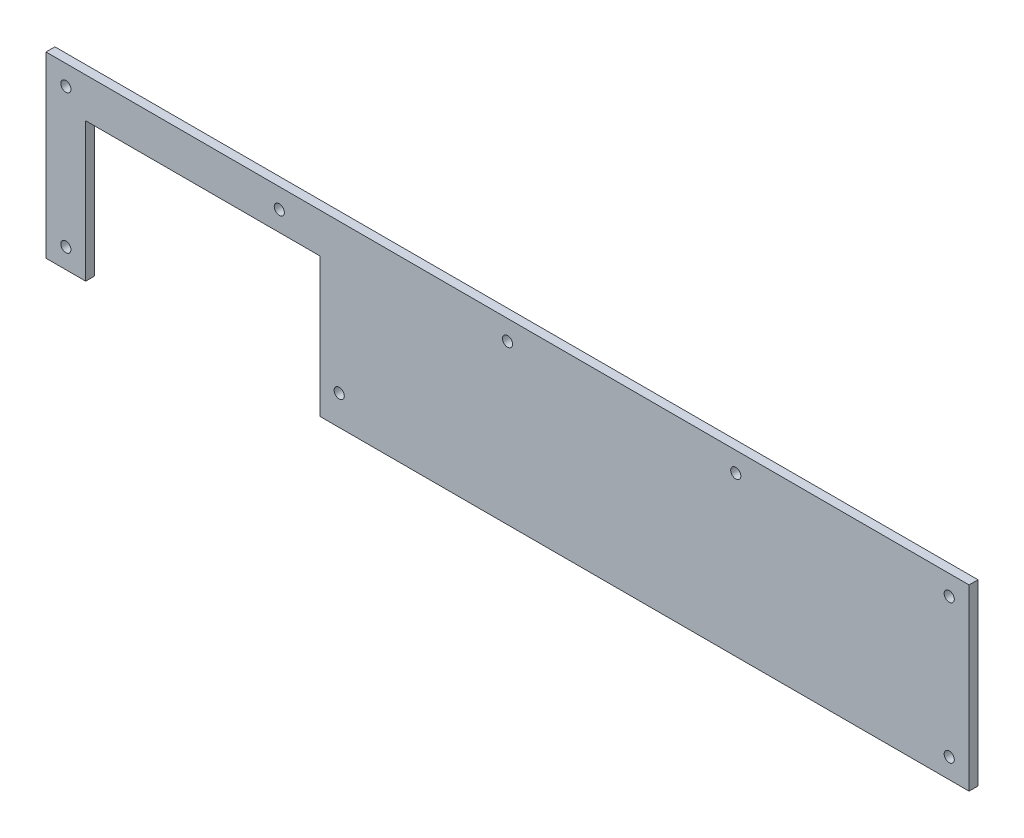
ISO-10303-21;
HEADER;
FILE_DESCRIPTION(('STEP AP214'),'2;1');
FILE_NAME('part.step','',(''),(''),'','','');
FILE_SCHEMA(('AUTOMOTIVE_DESIGN { 1 0 10303 214 1 1 1 1 }'));
ENDSEC;
DATA;
#1=APPLICATION_CONTEXT('core data for automotive mechanical design processes');
#2=APPLICATION_PROTOCOL_DEFINITION('international standard','automotive_design',2000,#1);
#3=PRODUCT_CONTEXT('',#1,'mechanical');
#4=PRODUCT('Part','Part','',(#3));
#5=PRODUCT_RELATED_PRODUCT_CATEGORY('part','',(#4));
#6=PRODUCT_DEFINITION_FORMATION('','',#4);
#7=PRODUCT_DEFINITION_CONTEXT('part definition',#1,'design');
#8=PRODUCT_DEFINITION('design','',#6,#7);
#9=PRODUCT_DEFINITION_SHAPE('','',#8);
#10=(LENGTH_UNIT() NAMED_UNIT(*) SI_UNIT(.MILLI.,.METRE.));
#11=(NAMED_UNIT(*) PLANE_ANGLE_UNIT() SI_UNIT($,.RADIAN.));
#12=(NAMED_UNIT(*) SI_UNIT($,.STERADIAN.) SOLID_ANGLE_UNIT());
#13=UNCERTAINTY_MEASURE_WITH_UNIT(LENGTH_MEASURE(1.E-05),#10,'distance_accuracy_value','');
#14=(GEOMETRIC_REPRESENTATION_CONTEXT(3) GLOBAL_UNCERTAINTY_ASSIGNED_CONTEXT((#13)) GLOBAL_UNIT_ASSIGNED_CONTEXT((#10,
#11,#12)) REPRESENTATION_CONTEXT('',''));
#15=CARTESIAN_POINT('',(0.,0.,0.));
#16=DIRECTION('',(0.,0.,1.));
#17=DIRECTION('',(1.,0.,0.));
#18=AXIS2_PLACEMENT_3D('',#15,#16,#17);
#19=CARTESIAN_POINT('',(-232.500000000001,-44.9999999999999,2.24789999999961));
#20=DIRECTION('',(0.,1.,0.));
#21=DIRECTION('',(0.,0.,1.));
#22=AXIS2_PLACEMENT_3D('',#19,#20,#21);
#23=PLANE('',#22);
#24=DIRECTION('',(1.00000000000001,0.,0.));
#25=VECTOR('',#24,1.);
#26=CARTESIAN_POINT('',(-232.500000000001,-45.,-2.24790000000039));
#27=LINE('',#26,#25);
#28=CARTESIAN_POINT('',(-232.500000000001,-45.,-2.24790000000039));
#29=VERTEX_POINT('',#28);
#30=CARTESIAN_POINT('',(-212.500000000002,-45.,-2.24790000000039));
#31=VERTEX_POINT('',#30);
#32=EDGE_CURVE('E203',#29,#31,#27,.T.);
#33=ORIENTED_EDGE('',*,*,#32,.T.);
#34=DIRECTION('',(0.,0.,-1.));
#35=VECTOR('',#34,1.);
#36=CARTESIAN_POINT('',(-212.500000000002,-44.9999999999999,2.24789999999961));
#37=LINE('',#36,#35);
#38=CARTESIAN_POINT('',(-212.500000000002,-44.9999999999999,2.24789999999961));
#39=VERTEX_POINT('',#38);
#40=EDGE_CURVE('E153',#39,#31,#37,.T.);
#41=ORIENTED_EDGE('',*,*,#40,.F.);
#42=DIRECTION('',(1.00000000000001,0.,0.));
#43=VECTOR('',#42,1.);
#44=CARTESIAN_POINT('',(-232.500000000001,-44.9999999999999,2.24789999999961));
#45=LINE('',#44,#43);
#46=CARTESIAN_POINT('',(-232.500000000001,-44.9999999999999,2.24789999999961));
#47=VERTEX_POINT('',#46);
#48=EDGE_CURVE('E142',#47,#39,#45,.T.);
#49=ORIENTED_EDGE('',*,*,#48,.F.);
#50=DIRECTION('',(0.,0.,-1.));
#51=VECTOR('',#50,1.);
#52=CARTESIAN_POINT('',(-232.500000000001,-44.9999999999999,2.24789999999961));
#53=LINE('',#52,#51);
#54=EDGE_CURVE('E218',#47,#29,#53,.T.);
#55=ORIENTED_EDGE('',*,*,#54,.T.);
#56=EDGE_LOOP('',(#33,#41,#49,#55));
#57=FACE_BOUND('',#56,.T.);
#58=ADVANCED_FACE('F46',(#57),#23,.F.);
#59=CARTESIAN_POINT('',(0.,0.,2.2479));
#60=DIRECTION('',(0.,0.,-1.));
#61=DIRECTION('',(-1.00000000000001,0.,0.));
#62=AXIS2_PLACEMENT_3D('',#59,#60,#61);
#63=PLANE('',#62);
#64=CARTESIAN_POINT('',(-84.8000000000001,-30.,2.2479));
#65=DIRECTION('',(0.,0.,-1.));
#66=DIRECTION('',(-1.00000000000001,0.,0.));
#67=AXIS2_PLACEMENT_3D('',#64,#65,#66);
#68=CIRCLE('',#67,2.54999999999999);
#69=CARTESIAN_POINT('',(-87.3500000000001,-30.,2.24789999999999));
#70=VERTEX_POINT('',#69);
#71=EDGE_CURVE('E147',#70,#70,#68,.F.);
#72=ORIENTED_EDGE('',*,*,#71,.F.);
#73=EDGE_LOOP('',(#72));
#74=FACE_BOUND('',#73,.T.);
#75=ORIENTED_EDGE('',*,*,#48,.T.);
#76=DIRECTION('',(0.,1.,0.));
#77=VECTOR('',#76,1.);
#78=CARTESIAN_POINT('',(-212.500000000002,-44.9999999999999,2.24789999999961));
#79=LINE('',#78,#77);
#80=CARTESIAN_POINT('',(-212.500000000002,25.,2.2479));
#81=VERTEX_POINT('',#80);
#82=EDGE_CURVE('E123',#39,#81,#79,.T.);
#83=ORIENTED_EDGE('',*,*,#82,.T.);
#84=DIRECTION('',(1.00000000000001,0.,0.));
#85=VECTOR('',#84,1.);
#86=CARTESIAN_POINT('',(-212.500000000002,25.,2.2479));
#87=LINE('',#86,#85);
#88=CARTESIAN_POINT('',(-94.5000000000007,25.,2.2479));
#89=VERTEX_POINT('',#88);
#90=EDGE_CURVE('E134',#81,#89,#87,.T.);
#91=ORIENTED_EDGE('',*,*,#90,.T.);
#92=DIRECTION('',(0.,-1.,0.));
#93=VECTOR('',#92,1.);
#94=CARTESIAN_POINT('',(-94.5000000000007,-44.9999999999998,2.2479));
#95=LINE('',#94,#93);
#96=CARTESIAN_POINT('',(-94.5000000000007,-44.9999999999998,2.2479));
#97=VERTEX_POINT('',#96);
#98=EDGE_CURVE('E131',#89,#97,#95,.T.);
#99=ORIENTED_EDGE('',*,*,#98,.T.);
#100=CARTESIAN_POINT('',(232.500000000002,-44.9999999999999,2.24790000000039));
#101=VERTEX_POINT('',#100);
#102=EDGE_CURVE('E70',#97,#101,#45,.T.);
#103=ORIENTED_EDGE('',*,*,#102,.T.);
#104=DIRECTION('',(0.,1.,0.));
#105=VECTOR('',#104,1.);
#106=CARTESIAN_POINT('',(232.500000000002,-44.9999999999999,2.24790000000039));
#107=LINE('',#106,#105);
#108=CARTESIAN_POINT('',(232.500000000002,45.0000000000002,2.24790000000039));
#109=VERTEX_POINT('',#108);
#110=EDGE_CURVE('E201',#101,#109,#107,.T.);
#111=ORIENTED_EDGE('',*,*,#110,.T.);
#112=DIRECTION('',(-1.00000000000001,0.,0.));
#113=VECTOR('',#112,1.);
#114=CARTESIAN_POINT('',(-232.500000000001,45.,2.2479));
#115=LINE('',#114,#113);
#116=CARTESIAN_POINT('',(-232.500000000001,45.,2.2479));
#117=VERTEX_POINT('',#116);
#118=EDGE_CURVE('E98',#109,#117,#115,.T.);
#119=ORIENTED_EDGE('',*,*,#118,.T.);
#120=DIRECTION('',(0.,-1.,0.));
#121=VECTOR('',#120,1.);
#122=CARTESIAN_POINT('',(-232.500000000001,-44.9999999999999,2.24789999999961));
#123=LINE('',#122,#121);
#124=EDGE_CURVE('E205',#117,#47,#123,.T.);
#125=ORIENTED_EDGE('',*,*,#124,.T.);
#126=EDGE_LOOP('',(#75,#83,#91,#99,#103,#111,#119,#125));
#127=FACE_BOUND('',#126,.T.);
#128=CARTESIAN_POINT('',(-222.500000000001,35.,2.24789999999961));
#129=DIRECTION('',(0.,0.,1.));
#130=DIRECTION('',(1.00000000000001,0.,0.));
#131=AXIS2_PLACEMENT_3D('',#128,#129,#130);
#132=CIRCLE('',#131,2.54999999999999);
#133=CARTESIAN_POINT('',(-219.950000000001,35.,2.24789999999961));
#134=VERTEX_POINT('',#133);
#135=EDGE_CURVE('E195',#134,#134,#132,.T.);
#136=ORIENTED_EDGE('',*,*,#135,.F.);
#137=EDGE_LOOP('',(#136));
#138=FACE_BOUND('',#137,.T.);
#139=CARTESIAN_POINT('',(-222.500000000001,-34.9999999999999,2.24789999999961));
#140=DIRECTION('',(0.,0.,1.));
#141=DIRECTION('',(1.00000000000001,0.,0.));
#142=AXIS2_PLACEMENT_3D('',#139,#140,#141);
#143=CIRCLE('',#142,2.54999999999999);
#144=CARTESIAN_POINT('',(-219.950000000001,-34.9999999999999,2.24789999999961));
#145=VERTEX_POINT('',#144);
#146=EDGE_CURVE('E189',#145,#145,#143,.T.);
#147=ORIENTED_EDGE('',*,*,#146,.F.);
#148=EDGE_LOOP('',(#147));
#149=FACE_BOUND('',#148,.T.);
#150=CARTESIAN_POINT('',(0.,35.,2.2479));
#151=DIRECTION('',(0.,0.,1.));
#152=DIRECTION('',(1.00000000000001,0.,0.));
#153=AXIS2_PLACEMENT_3D('',#150,#151,#152);
#154=CIRCLE('',#153,2.55);
#155=CARTESIAN_POINT('',(2.55000000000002,35.,2.2479));
#156=VERTEX_POINT('',#155);
#157=EDGE_CURVE('E183',#156,#156,#154,.T.);
#158=ORIENTED_EDGE('',*,*,#157,.F.);
#159=EDGE_LOOP('',(#158));
#160=FACE_BOUND('',#159,.T.);
#161=CARTESIAN_POINT('',(-114.975000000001,35.,2.2479));
#162=DIRECTION('',(0.,0.,1.));
#163=DIRECTION('',(1.00000000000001,0.,0.));
#164=AXIS2_PLACEMENT_3D('',#161,#162,#163);
#165=CIRCLE('',#164,2.54999999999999);
#166=CARTESIAN_POINT('',(-112.425000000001,35.,2.2479));
#167=VERTEX_POINT('',#166);
#168=EDGE_CURVE('E177',#167,#167,#165,.T.);
#169=ORIENTED_EDGE('',*,*,#168,.F.);
#170=EDGE_LOOP('',(#169));
#171=FACE_BOUND('',#170,.T.);
#172=CARTESIAN_POINT('',(222.500000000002,-34.9999999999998,2.24790000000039));
#173=DIRECTION('',(0.,0.,1.));
#174=DIRECTION('',(-1.00000000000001,0.,0.));
#175=AXIS2_PLACEMENT_3D('',#172,#173,#174);
#176=CIRCLE('',#175,2.54999999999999);
#177=CARTESIAN_POINT('',(219.950000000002,-34.9999999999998,2.24790000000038));
#178=VERTEX_POINT('',#177);
#179=EDGE_CURVE('E171',#178,#178,#176,.T.);
#180=ORIENTED_EDGE('',*,*,#179,.F.);
#181=EDGE_LOOP('',(#180));
#182=FACE_BOUND('',#181,.T.);
#183=CARTESIAN_POINT('',(222.500000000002,35.0000000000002,2.24790000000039));
#184=DIRECTION('',(0.,0.,1.));
#185=DIRECTION('',(-1.00000000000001,0.,0.));
#186=AXIS2_PLACEMENT_3D('',#183,#184,#185);
#187=CIRCLE('',#186,2.54999999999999);
#188=CARTESIAN_POINT('',(219.950000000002,35.0000000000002,2.24790000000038));
#189=VERTEX_POINT('',#188);
#190=EDGE_CURVE('E165',#189,#189,#187,.T.);
#191=ORIENTED_EDGE('',*,*,#190,.F.);
#192=EDGE_LOOP('',(#191));
#193=FACE_BOUND('',#192,.T.);
#194=CARTESIAN_POINT('',(114.975000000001,35.,2.24790000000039));
#195=DIRECTION('',(0.,0.,1.));
#196=DIRECTION('',(-1.00000000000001,0.,0.));
#197=AXIS2_PLACEMENT_3D('',#194,#195,#196);
#198=CIRCLE('',#197,2.54999999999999);
#199=CARTESIAN_POINT('',(112.425000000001,35.,2.24790000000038));
#200=VERTEX_POINT('',#199);
#201=EDGE_CURVE('E159',#200,#200,#198,.T.);
#202=ORIENTED_EDGE('',*,*,#201,.F.);
#203=EDGE_LOOP('',(#202));
#204=FACE_BOUND('',#203,.T.);
#205=ADVANCED_FACE('F139',(#74,#127,#138,#149,#160,#171,#182,#193,#204),#63,.F.);
#206=CARTESIAN_POINT('',(0.,1.94289029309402E-13,-2.2479));
#207=DIRECTION('',(0.,0.,-1.));
#208=DIRECTION('',(-1.00000000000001,0.,0.));
#209=AXIS2_PLACEMENT_3D('',#206,#207,#208);
#210=PLANE('',#209);
#211=CARTESIAN_POINT('',(-84.8000000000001,-30.,-2.2479));
#212=DIRECTION('',(0.,0.,-1.));
#213=DIRECTION('',(-1.00000000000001,0.,0.));
#214=AXIS2_PLACEMENT_3D('',#211,#212,#213);
#215=CIRCLE('',#214,2.54999999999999);
#216=CARTESIAN_POINT('',(-87.3500000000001,-30.,-2.2479));
#217=VERTEX_POINT('',#216);
#218=EDGE_CURVE('E306',#217,#217,#215,.T.);
#219=ORIENTED_EDGE('',*,*,#218,.F.);
#220=EDGE_LOOP('',(#219));
#221=FACE_BOUND('',#220,.T.);
#222=DIRECTION('',(0.,1.,0.));
#223=VECTOR('',#222,1.);
#224=CARTESIAN_POINT('',(-212.500000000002,-45.,-2.24790000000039));
#225=LINE('',#224,#223);
#226=CARTESIAN_POINT('',(-212.500000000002,25.,-2.24790000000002));
#227=VERTEX_POINT('',#226);
#228=EDGE_CURVE('E126',#31,#227,#225,.T.);
#229=ORIENTED_EDGE('',*,*,#228,.F.);
#230=ORIENTED_EDGE('',*,*,#32,.F.);
#231=DIRECTION('',(0.,-1.,0.));
#232=VECTOR('',#231,1.);
#233=CARTESIAN_POINT('',(-232.500000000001,-45.,-2.24790000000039));
#234=LINE('',#233,#232);
#235=CARTESIAN_POINT('',(-232.500000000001,45.,-2.2479));
#236=VERTEX_POINT('',#235);
#237=EDGE_CURVE('E213',#236,#29,#234,.T.);
#238=ORIENTED_EDGE('',*,*,#237,.F.);
#239=DIRECTION('',(-1.00000000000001,0.,0.));
#240=VECTOR('',#239,1.);
#241=CARTESIAN_POINT('',(-232.500000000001,45.,-2.2479));
#242=LINE('',#241,#240);
#243=CARTESIAN_POINT('',(232.500000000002,45.0000000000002,-2.24789999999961));
#244=VERTEX_POINT('',#243);
#245=EDGE_CURVE('E211',#244,#236,#242,.T.);
#246=ORIENTED_EDGE('',*,*,#245,.F.);
#247=DIRECTION('',(0.,1.,0.));
#248=VECTOR('',#247,1.);
#249=CARTESIAN_POINT('',(232.500000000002,-45.,-2.24789999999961));
#250=LINE('',#249,#248);
#251=CARTESIAN_POINT('',(232.500000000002,-45.,-2.24789999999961));
#252=VERTEX_POINT('',#251);
#253=EDGE_CURVE('E198',#252,#244,#250,.T.);
#254=ORIENTED_EDGE('',*,*,#253,.F.);
#255=CARTESIAN_POINT('',(-94.5000000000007,-45.,-2.2479));
#256=VERTEX_POINT('',#255);
#257=EDGE_CURVE('E91',#256,#252,#27,.T.);
#258=ORIENTED_EDGE('',*,*,#257,.F.);
#259=DIRECTION('',(0.,-1.,0.));
#260=VECTOR('',#259,1.);
#261=CARTESIAN_POINT('',(-94.5000000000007,-45.,-2.2479));
#262=LINE('',#261,#260);
#263=CARTESIAN_POINT('',(-94.5000000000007,25.,-2.24790000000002));
#264=VERTEX_POINT('',#263);
#265=EDGE_CURVE('E61',#264,#256,#262,.T.);
#266=ORIENTED_EDGE('',*,*,#265,.F.);
#267=DIRECTION('',(1.00000000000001,0.,0.));
#268=VECTOR('',#267,1.);
#269=CARTESIAN_POINT('',(-212.500000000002,25.,-2.24790000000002));
#270=LINE('',#269,#268);
#271=EDGE_CURVE('E144',#227,#264,#270,.T.);
#272=ORIENTED_EDGE('',*,*,#271,.F.);
#273=EDGE_LOOP('',(#229,#230,#238,#246,#254,#258,#266,#272));
#274=FACE_BOUND('',#273,.T.);
#275=CARTESIAN_POINT('',(222.500000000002,35.0000000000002,-2.24789999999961));
#276=DIRECTION('',(0.,0.,1.));
#277=DIRECTION('',(-1.00000000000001,0.,0.));
#278=AXIS2_PLACEMENT_3D('',#275,#276,#277);
#279=CIRCLE('',#278,2.54999999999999);
#280=CARTESIAN_POINT('',(219.950000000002,35.0000000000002,-2.24789999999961));
#281=VERTEX_POINT('',#280);
#282=EDGE_CURVE('E162',#281,#281,#279,.T.);
#283=ORIENTED_EDGE('',*,*,#282,.T.);
#284=EDGE_LOOP('',(#283));
#285=FACE_BOUND('',#284,.T.);
#286=CARTESIAN_POINT('',(-114.975000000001,35.,-2.2479));
#287=DIRECTION('',(0.,0.,1.));
#288=DIRECTION('',(1.00000000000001,0.,0.));
#289=AXIS2_PLACEMENT_3D('',#286,#287,#288);
#290=CIRCLE('',#289,2.54999999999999);
#291=CARTESIAN_POINT('',(-112.425000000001,35.,-2.24789999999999));
#292=VERTEX_POINT('',#291);
#293=EDGE_CURVE('E174',#292,#292,#290,.T.);
#294=ORIENTED_EDGE('',*,*,#293,.T.);
#295=EDGE_LOOP('',(#294));
#296=FACE_BOUND('',#295,.T.);
#297=CARTESIAN_POINT('',(-222.500000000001,-35.,-2.24790000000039));
#298=DIRECTION('',(0.,0.,1.));
#299=DIRECTION('',(1.00000000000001,0.,0.));
#300=AXIS2_PLACEMENT_3D('',#297,#298,#299);
#301=CIRCLE('',#300,2.54999999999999);
#302=CARTESIAN_POINT('',(-219.950000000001,-35.,-2.24790000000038));
#303=VERTEX_POINT('',#302);
#304=EDGE_CURVE('E186',#303,#303,#301,.T.);
#305=ORIENTED_EDGE('',*,*,#304,.T.);
#306=EDGE_LOOP('',(#305));
#307=FACE_BOUND('',#306,.T.);
#308=CARTESIAN_POINT('',(-222.500000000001,35.,-2.24790000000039));
#309=DIRECTION('',(0.,0.,1.));
#310=DIRECTION('',(1.00000000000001,0.,0.));
#311=AXIS2_PLACEMENT_3D('',#308,#309,#310);
#312=CIRCLE('',#311,2.54999999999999);
#313=CARTESIAN_POINT('',(-219.950000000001,35.,-2.24790000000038));
#314=VERTEX_POINT('',#313);
#315=EDGE_CURVE('E192',#314,#314,#312,.T.);
#316=ORIENTED_EDGE('',*,*,#315,.T.);
#317=EDGE_LOOP('',(#316));
#318=FACE_BOUND('',#317,.T.);
#319=CARTESIAN_POINT('',(0.,35.,-2.2479));
#320=DIRECTION('',(0.,0.,1.));
#321=DIRECTION('',(1.00000000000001,0.,0.));
#322=AXIS2_PLACEMENT_3D('',#319,#320,#321);
#323=CIRCLE('',#322,2.55);
#324=CARTESIAN_POINT('',(2.55000000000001,35.,-2.24789999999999));
#325=VERTEX_POINT('',#324);
#326=EDGE_CURVE('E180',#325,#325,#323,.T.);
#327=ORIENTED_EDGE('',*,*,#326,.T.);
#328=EDGE_LOOP('',(#327));
#329=FACE_BOUND('',#328,.T.);
#330=CARTESIAN_POINT('',(222.500000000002,-34.9999999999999,-2.24789999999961));
#331=DIRECTION('',(0.,0.,1.));
#332=DIRECTION('',(-1.00000000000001,0.,0.));
#333=AXIS2_PLACEMENT_3D('',#330,#331,#332);
#334=CIRCLE('',#333,2.54999999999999);
#335=CARTESIAN_POINT('',(219.950000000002,-34.9999999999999,-2.24789999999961));
#336=VERTEX_POINT('',#335);
#337=EDGE_CURVE('E168',#336,#336,#334,.T.);
#338=ORIENTED_EDGE('',*,*,#337,.T.);
#339=EDGE_LOOP('',(#338));
#340=FACE_BOUND('',#339,.T.);
#341=CARTESIAN_POINT('',(114.975000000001,35.,-2.24789999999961));
#342=DIRECTION('',(0.,0.,1.));
#343=DIRECTION('',(-1.00000000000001,0.,0.));
#344=AXIS2_PLACEMENT_3D('',#341,#342,#343);
#345=CIRCLE('',#344,2.54999999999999);
#346=CARTESIAN_POINT('',(112.425000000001,35.,-2.24789999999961));
#347=VERTEX_POINT('',#346);
#348=EDGE_CURVE('E155',#347,#347,#345,.T.);
#349=ORIENTED_EDGE('',*,*,#348,.T.);
#350=EDGE_LOOP('',(#349));
#351=FACE_BOUND('',#350,.T.);
#352=ADVANCED_FACE('F228',(#221,#274,#285,#296,#307,#318,#329,#340,#351),#210,.T.);
#353=CARTESIAN_POINT('',(232.500000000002,-44.9999999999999,2.24790000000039));
#354=DIRECTION('',(-1.00000000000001,0.,0.));
#355=DIRECTION('',(0.,0.,1.));
#356=AXIS2_PLACEMENT_3D('',#353,#354,#355);
#357=PLANE('',#356);
#358=ORIENTED_EDGE('',*,*,#253,.T.);
#359=DIRECTION('',(0.,0.,-1.));
#360=VECTOR('',#359,1.);
#361=CARTESIAN_POINT('',(232.500000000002,45.0000000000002,2.24790000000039));
#362=LINE('',#361,#360);
#363=EDGE_CURVE('E13',#109,#244,#362,.T.);
#364=ORIENTED_EDGE('',*,*,#363,.F.);
#365=ORIENTED_EDGE('',*,*,#110,.F.);
#366=DIRECTION('',(0.,0.,-1.));
#367=VECTOR('',#366,1.);
#368=CARTESIAN_POINT('',(232.500000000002,-44.9999999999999,2.24790000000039));
#369=LINE('',#368,#367);
#370=EDGE_CURVE('E208',#101,#252,#369,.T.);
#371=ORIENTED_EDGE('',*,*,#370,.T.);
#372=EDGE_LOOP('',(#358,#364,#365,#371));
#373=FACE_BOUND('',#372,.T.);
#374=ADVANCED_FACE('F48',(#373),#357,.F.);
#375=CARTESIAN_POINT('',(-232.500000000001,45.,2.2479));
#376=DIRECTION('',(0.,-1.,0.));
#377=DIRECTION('',(0.,0.,-1.));
#378=AXIS2_PLACEMENT_3D('',#375,#376,#377);
#379=PLANE('',#378);
#380=ORIENTED_EDGE('',*,*,#245,.T.);
#381=DIRECTION('',(0.,0.,-1.));
#382=VECTOR('',#381,1.);
#383=CARTESIAN_POINT('',(-232.500000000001,45.,2.2479));
#384=LINE('',#383,#382);
#385=EDGE_CURVE('E54',#117,#236,#384,.T.);
#386=ORIENTED_EDGE('',*,*,#385,.F.);
#387=ORIENTED_EDGE('',*,*,#118,.F.);
#388=ORIENTED_EDGE('',*,*,#363,.T.);
#389=EDGE_LOOP('',(#380,#386,#387,#388));
#390=FACE_BOUND('',#389,.T.);
#391=ADVANCED_FACE('F251',(#390),#379,.F.);
#392=CARTESIAN_POINT('',(-232.500000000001,-44.9999999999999,2.24789999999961));
#393=DIRECTION('',(1.00000000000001,0.,0.));
#394=DIRECTION('',(0.,0.,-1.));
#395=AXIS2_PLACEMENT_3D('',#392,#393,#394);
#396=PLANE('',#395);
#397=ORIENTED_EDGE('',*,*,#237,.T.);
#398=ORIENTED_EDGE('',*,*,#54,.F.);
#399=ORIENTED_EDGE('',*,*,#124,.F.);
#400=ORIENTED_EDGE('',*,*,#385,.T.);
#401=EDGE_LOOP('',(#397,#398,#399,#400));
#402=FACE_BOUND('',#401,.T.);
#403=ADVANCED_FACE('F224',(#402),#396,.F.);
#404=ORIENTED_EDGE('',*,*,#102,.F.);
#405=DIRECTION('',(0.,0.,-1.));
#406=VECTOR('',#405,1.);
#407=CARTESIAN_POINT('',(-94.5000000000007,-44.9999999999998,2.2479));
#408=LINE('',#407,#406);
#409=EDGE_CURVE('E156',#97,#256,#408,.T.);
#410=ORIENTED_EDGE('',*,*,#409,.T.);
#411=ORIENTED_EDGE('',*,*,#257,.T.);
#412=ORIENTED_EDGE('',*,*,#370,.F.);
#413=EDGE_LOOP('',(#404,#410,#411,#412));
#414=FACE_BOUND('',#413,.T.);
#415=ADVANCED_FACE('F234',(#414),#23,.F.);
#416=CARTESIAN_POINT('',(-222.500000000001,35.,2.24789999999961));
#417=DIRECTION('',(0.,0.,-1.));
#418=DIRECTION('',(-1.00000000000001,0.,0.));
#419=AXIS2_PLACEMENT_3D('',#416,#417,#418);
#420=CYLINDRICAL_SURFACE('',#419,2.54999999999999);
#421=ORIENTED_EDGE('',*,*,#135,.T.);
#422=EDGE_LOOP('',(#421));
#423=FACE_BOUND('',#422,.T.);
#424=ORIENTED_EDGE('',*,*,#315,.F.);
#425=EDGE_LOOP('',(#424));
#426=FACE_BOUND('',#425,.T.);
#427=ADVANCED_FACE('F243',(#423,#426),#420,.F.);
#428=CARTESIAN_POINT('',(-222.500000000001,-34.9999999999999,2.24789999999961));
#429=DIRECTION('',(0.,0.,-1.));
#430=DIRECTION('',(-1.00000000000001,0.,0.));
#431=AXIS2_PLACEMENT_3D('',#428,#429,#430);
#432=CYLINDRICAL_SURFACE('',#431,2.54999999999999);
#433=ORIENTED_EDGE('',*,*,#146,.T.);
#434=EDGE_LOOP('',(#433));
#435=FACE_BOUND('',#434,.T.);
#436=ORIENTED_EDGE('',*,*,#304,.F.);
#437=EDGE_LOOP('',(#436));
#438=FACE_BOUND('',#437,.T.);
#439=ADVANCED_FACE('F248',(#435,#438),#432,.F.);
#440=CARTESIAN_POINT('',(0.,35.,2.2479));
#441=DIRECTION('',(0.,0.,-1.));
#442=DIRECTION('',(-1.00000000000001,0.,0.));
#443=AXIS2_PLACEMENT_3D('',#440,#441,#442);
#444=CYLINDRICAL_SURFACE('',#443,2.55);
#445=ORIENTED_EDGE('',*,*,#157,.T.);
#446=EDGE_LOOP('',(#445));
#447=FACE_BOUND('',#446,.T.);
#448=ORIENTED_EDGE('',*,*,#326,.F.);
#449=EDGE_LOOP('',(#448));
#450=FACE_BOUND('',#449,.T.);
#451=ADVANCED_FACE('F269',(#447,#450),#444,.F.);
#452=CARTESIAN_POINT('',(-114.975000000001,35.,2.2479));
#453=DIRECTION('',(0.,0.,-1.));
#454=DIRECTION('',(-1.00000000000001,0.,0.));
#455=AXIS2_PLACEMENT_3D('',#452,#453,#454);
#456=CYLINDRICAL_SURFACE('',#455,2.54999999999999);
#457=ORIENTED_EDGE('',*,*,#168,.T.);
#458=EDGE_LOOP('',(#457));
#459=FACE_BOUND('',#458,.T.);
#460=ORIENTED_EDGE('',*,*,#293,.F.);
#461=EDGE_LOOP('',(#460));
#462=FACE_BOUND('',#461,.T.);
#463=ADVANCED_FACE('F273',(#459,#462),#456,.F.);
#464=CARTESIAN_POINT('',(222.500000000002,-34.9999999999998,2.24790000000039));
#465=DIRECTION('',(0.,0.,-1.));
#466=DIRECTION('',(-1.00000000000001,0.,0.));
#467=AXIS2_PLACEMENT_3D('',#464,#465,#466);
#468=CYLINDRICAL_SURFACE('',#467,2.54999999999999);
#469=ORIENTED_EDGE('',*,*,#179,.T.);
#470=EDGE_LOOP('',(#469));
#471=FACE_BOUND('',#470,.T.);
#472=ORIENTED_EDGE('',*,*,#337,.F.);
#473=EDGE_LOOP('',(#472));
#474=FACE_BOUND('',#473,.T.);
#475=ADVANCED_FACE('F277',(#471,#474),#468,.F.);
#476=CARTESIAN_POINT('',(222.500000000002,35.0000000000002,2.24790000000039));
#477=DIRECTION('',(0.,0.,-1.));
#478=DIRECTION('',(-1.00000000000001,0.,0.));
#479=AXIS2_PLACEMENT_3D('',#476,#477,#478);
#480=CYLINDRICAL_SURFACE('',#479,2.54999999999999);
#481=ORIENTED_EDGE('',*,*,#190,.T.);
#482=EDGE_LOOP('',(#481));
#483=FACE_BOUND('',#482,.T.);
#484=ORIENTED_EDGE('',*,*,#282,.F.);
#485=EDGE_LOOP('',(#484));
#486=FACE_BOUND('',#485,.T.);
#487=ADVANCED_FACE('F281',(#483,#486),#480,.F.);
#488=CARTESIAN_POINT('',(114.975000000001,35.,2.24790000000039));
#489=DIRECTION('',(0.,0.,-1.));
#490=DIRECTION('',(-1.00000000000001,0.,0.));
#491=AXIS2_PLACEMENT_3D('',#488,#489,#490);
#492=CYLINDRICAL_SURFACE('',#491,2.54999999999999);
#493=ORIENTED_EDGE('',*,*,#201,.T.);
#494=EDGE_LOOP('',(#493));
#495=FACE_BOUND('',#494,.T.);
#496=ORIENTED_EDGE('',*,*,#348,.F.);
#497=EDGE_LOOP('',(#496));
#498=FACE_BOUND('',#497,.T.);
#499=ADVANCED_FACE('F285',(#495,#498),#492,.F.);
#500=CARTESIAN_POINT('',(-212.500000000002,-44.9999999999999,2.24789999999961));
#501=DIRECTION('',(-1.00000000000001,0.,0.));
#502=DIRECTION('',(0.,0.,1.));
#503=AXIS2_PLACEMENT_3D('',#500,#501,#502);
#504=PLANE('',#503);
#505=ORIENTED_EDGE('',*,*,#228,.T.);
#506=DIRECTION('',(0.,0.,-1.));
#507=VECTOR('',#506,1.);
#508=CARTESIAN_POINT('',(-212.500000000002,25.,2.2479));
#509=LINE('',#508,#507);
#510=EDGE_CURVE('E119',#81,#227,#509,.T.);
#511=ORIENTED_EDGE('',*,*,#510,.F.);
#512=ORIENTED_EDGE('',*,*,#82,.F.);
#513=ORIENTED_EDGE('',*,*,#40,.T.);
#514=EDGE_LOOP('',(#505,#511,#512,#513));
#515=FACE_BOUND('',#514,.T.);
#516=ADVANCED_FACE('F121',(#515),#504,.F.);
#517=CARTESIAN_POINT('',(-94.5000000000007,-44.9999999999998,2.2479));
#518=DIRECTION('',(1.00000000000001,0.,0.));
#519=DIRECTION('',(0.,0.,-1.));
#520=AXIS2_PLACEMENT_3D('',#517,#518,#519);
#521=PLANE('',#520);
#522=ORIENTED_EDGE('',*,*,#265,.T.);
#523=ORIENTED_EDGE('',*,*,#409,.F.);
#524=ORIENTED_EDGE('',*,*,#98,.F.);
#525=DIRECTION('',(0.,0.,-1.));
#526=VECTOR('',#525,1.);
#527=CARTESIAN_POINT('',(-94.5000000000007,25.,2.2479));
#528=LINE('',#527,#526);
#529=EDGE_CURVE('E130',#89,#264,#528,.T.);
#530=ORIENTED_EDGE('',*,*,#529,.T.);
#531=EDGE_LOOP('',(#522,#523,#524,#530));
#532=FACE_BOUND('',#531,.T.);
#533=ADVANCED_FACE('F292',(#532),#521,.F.);
#534=CARTESIAN_POINT('',(-212.500000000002,25.,2.2479));
#535=DIRECTION('',(0.,1.,0.));
#536=DIRECTION('',(-1.00000000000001,0.,0.));
#537=AXIS2_PLACEMENT_3D('',#534,#535,#536);
#538=PLANE('',#537);
#539=ORIENTED_EDGE('',*,*,#271,.T.);
#540=ORIENTED_EDGE('',*,*,#529,.F.);
#541=ORIENTED_EDGE('',*,*,#90,.F.);
#542=ORIENTED_EDGE('',*,*,#510,.T.);
#543=EDGE_LOOP('',(#539,#540,#541,#542));
#544=FACE_BOUND('',#543,.T.);
#545=ADVANCED_FACE('F135',(#544),#538,.F.);
#546=CARTESIAN_POINT('',(-84.8000000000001,-30.,9.46038916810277));
#547=DIRECTION('',(0.,0.,-1.));
#548=DIRECTION('',(-1.00000000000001,0.,0.));
#549=AXIS2_PLACEMENT_3D('',#546,#547,#548);
#550=CYLINDRICAL_SURFACE('',#549,2.54999999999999);
#551=ORIENTED_EDGE('',*,*,#71,.T.);
#552=EDGE_LOOP('',(#551));
#553=FACE_BOUND('',#552,.T.);
#554=ORIENTED_EDGE('',*,*,#218,.T.);
#555=EDGE_LOOP('',(#554));
#556=FACE_BOUND('',#555,.T.);
#557=ADVANCED_FACE('F295',(#553,#556),#550,.F.);
#558=CLOSED_SHELL('',(#58,#205,#352,#374,#391,#403,#415,#427,#439,#451,#463,#475,#487,#499,#516,
#533,#545,#557));
#559=MANIFOLD_SOLID_BREP('B2',#558);
#560=ADVANCED_BREP_SHAPE_REPRESENTATION('',(#18,#559),#14);
#561=SHAPE_DEFINITION_REPRESENTATION(#9,#560);
ENDSEC;
END-ISO-10303-21;
